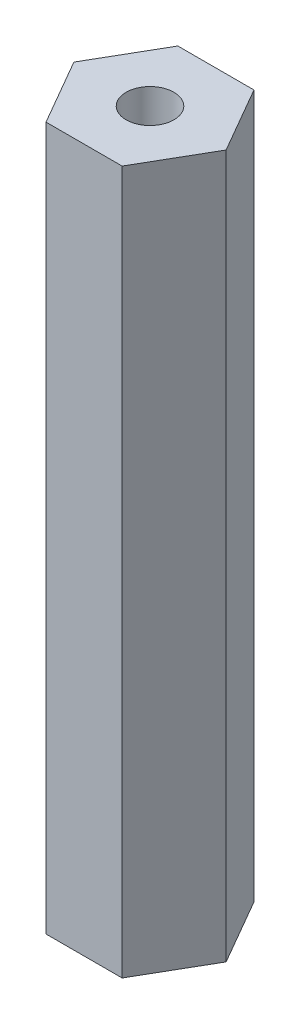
from build123d import *

# Parameters (mm, degrees)
BASE_EXTRUDE_DEPTH        = 50.8
F_8_32_TAPPED_HOLE1_D     = 3.4544
F_8_32_TAPPED_HOLE1_DEPTH = 13.8684
F_8_32_TAPPED_HOLE1_TIP   = 1.037806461
F_8_32_TAPPED_HOLE2_D     = 3.4544
F_8_32_TAPPED_HOLE2_DEPTH = 13.8684
F_8_32_TAPPED_HOLE2_TIP   = 1.037806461


with BuildPart() as part:
    # Sketch1 → Base-Extrude (new body)
    with BuildSketch(Plane(origin=(0, 0, 0), x_dir=(1, 0, 0), z_dir=(0, 1, 0))):
        Polygon((5.499261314, 0), (2.749630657, 4.7625), (-2.749630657, 4.7625), (-5.499261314, 0), (-2.749630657, -4.7625), (2.749630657, -4.7625), align=None)
    extrude(amount=BASE_EXTRUDE_DEPTH)

    # 8-32 Tapped Hole1
    with Locations(Plane(origin=(0, 50.8, 0), x_dir=(-1, 0, 0), z_dir=(0, 1, 0))):
        with Locations((0, 0)):
            Hole(F_8_32_TAPPED_HOLE1_D / 2, depth=F_8_32_TAPPED_HOLE1_DEPTH)
            with Locations((0, 0, -(F_8_32_TAPPED_HOLE1_DEPTH + F_8_32_TAPPED_HOLE1_TIP / 2))):  # 118° drill point
                Cone(0, F_8_32_TAPPED_HOLE1_D / 2, F_8_32_TAPPED_HOLE1_TIP, mode=Mode.SUBTRACT)

    # 8-32 Tapped Hole2
    with Locations(Plane.XZ):
        with Locations((0, 0)):
            Hole(F_8_32_TAPPED_HOLE2_D / 2, depth=F_8_32_TAPPED_HOLE2_DEPTH)
            with Locations((0, 0, -(F_8_32_TAPPED_HOLE2_DEPTH + F_8_32_TAPPED_HOLE2_TIP / 2))):  # 118° drill point
                Cone(0, F_8_32_TAPPED_HOLE2_D / 2, F_8_32_TAPPED_HOLE2_TIP, mode=Mode.SUBTRACT)


solid = part.part
